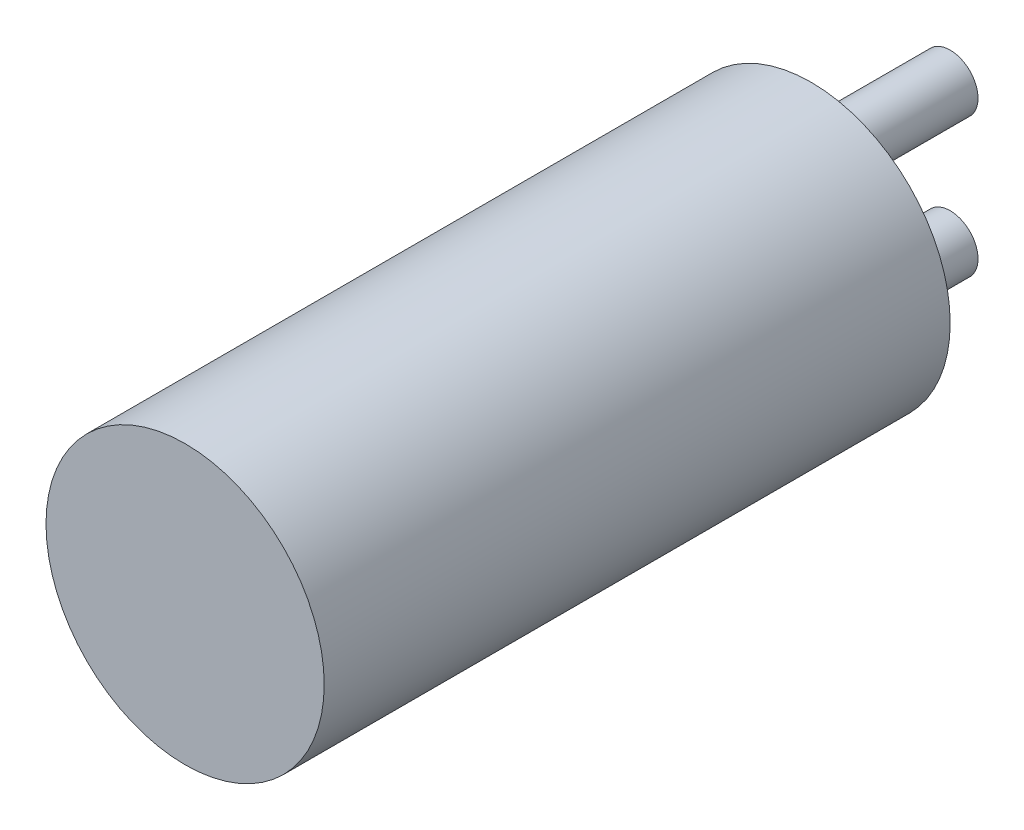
from build123d import *

# Parameters (mm, degrees)
SKETCH_1_R      = 2.54
EXTRUDE_1_DEPTH = 11.43
SKETCH_2_R      = 0.508
EXTRUDE_2_DEPTH = 2.54


with BuildPart() as part:
    # Sketch 1 → Extrude 1 (new body)
    with BuildSketch(Plane.XY):
        Circle(SKETCH_1_R)
    extrude(amount=EXTRUDE_1_DEPTH)

    # Sketch 2 → Extrude 2 (add)
    with BuildSketch(Plane(origin=(0, 0, 0), x_dir=(-1, 0, 0), z_dir=(0, 0, -1))):
        with Locations(Location((0, 1.27, 0), (0, 0, 180))):
            Circle(SKETCH_2_R)
        with Locations(Location((0, -1.27, 0), (0, 0, 180))):
            Circle(SKETCH_2_R)
    extrude(amount=EXTRUDE_2_DEPTH)


solid = part.part
